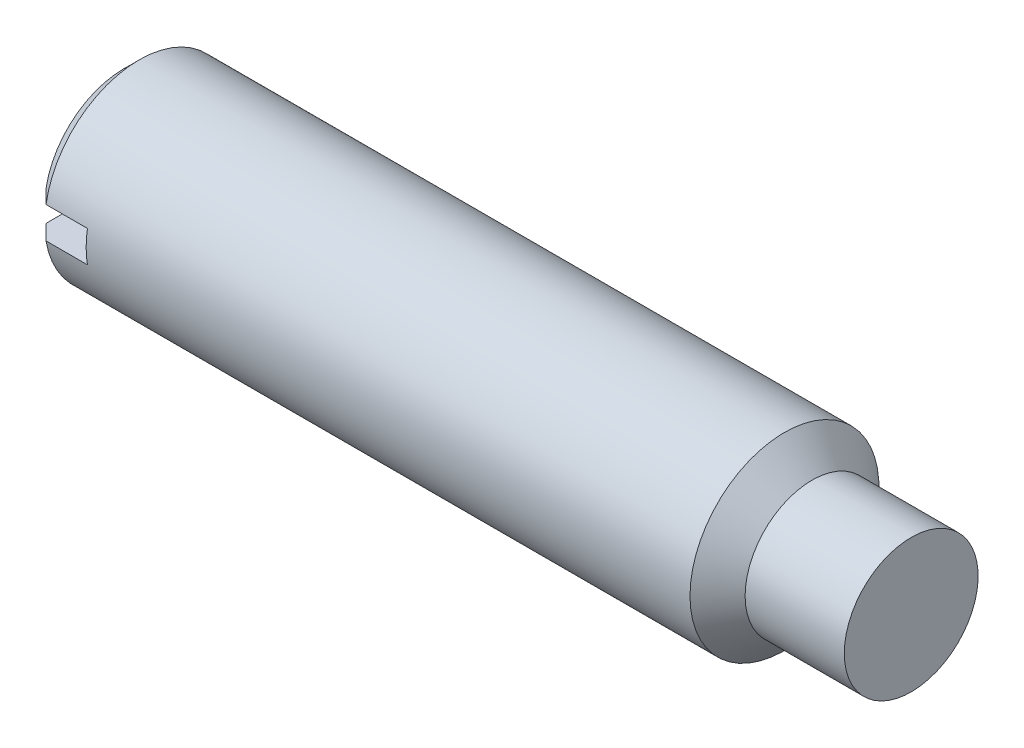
ISO-10303-21;
HEADER;
FILE_DESCRIPTION(('STEP AP214'),'2;1');
FILE_NAME('part.step','',(''),(''),'','','');
FILE_SCHEMA(('AUTOMOTIVE_DESIGN { 1 0 10303 214 1 1 1 1 }'));
ENDSEC;
DATA;
#1=APPLICATION_CONTEXT('core data for automotive mechanical design processes');
#2=APPLICATION_PROTOCOL_DEFINITION('international standard','automotive_design',2000,#1);
#3=PRODUCT_CONTEXT('',#1,'mechanical');
#4=PRODUCT('Part','Part','',(#3));
#5=PRODUCT_RELATED_PRODUCT_CATEGORY('part','',(#4));
#6=PRODUCT_DEFINITION_FORMATION('','',#4);
#7=PRODUCT_DEFINITION_CONTEXT('part definition',#1,'design');
#8=PRODUCT_DEFINITION('design','',#6,#7);
#9=PRODUCT_DEFINITION_SHAPE('','',#8);
#10=(LENGTH_UNIT() NAMED_UNIT(*) SI_UNIT(.MILLI.,.METRE.));
#11=(NAMED_UNIT(*) PLANE_ANGLE_UNIT() SI_UNIT($,.RADIAN.));
#12=(NAMED_UNIT(*) SI_UNIT($,.STERADIAN.) SOLID_ANGLE_UNIT());
#13=UNCERTAINTY_MEASURE_WITH_UNIT(LENGTH_MEASURE(1.E-05),#10,'distance_accuracy_value','');
#14=(GEOMETRIC_REPRESENTATION_CONTEXT(3) GLOBAL_UNCERTAINTY_ASSIGNED_CONTEXT((#13)) GLOBAL_UNIT_ASSIGNED_CONTEXT((#10,
#11,#12)) REPRESENTATION_CONTEXT('',''));
#15=CARTESIAN_POINT('',(0.,0.,0.));
#16=DIRECTION('',(0.,0.,1.));
#17=DIRECTION('',(1.,0.,0.));
#18=AXIS2_PLACEMENT_3D('',#15,#16,#17);
#19=CARTESIAN_POINT('',(0.,0.,0.));
#20=DIRECTION('',(1.,0.,0.));
#21=DIRECTION('',(0.,0.,-1.));
#22=AXIS2_PLACEMENT_3D('',#19,#20,#21);
#23=PLANE('',#22);
#24=DIRECTION('',(0.,0.,-1.));
#25=VECTOR('',#24,1.);
#26=CARTESIAN_POINT('',(0.,-1.,6.));
#27=LINE('',#26,#25);
#28=CARTESIAN_POINT('',(0.,-1.,4.93571636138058));
#29=VERTEX_POINT('',#28);
#30=CARTESIAN_POINT('',(0.,-1.,-4.93571636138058));
#31=VERTEX_POINT('',#30);
#32=EDGE_CURVE('E173',#29,#31,#27,.T.);
#33=ORIENTED_EDGE('',*,*,#32,.T.);
#34=CARTESIAN_POINT('',(0.,0.,0.));
#35=DIRECTION('',(-1.,0.,0.));
#36=DIRECTION('',(0.,0.,1.));
#37=AXIS2_PLACEMENT_3D('',#34,#35,#36);
#38=CIRCLE('',#37,5.036);
#39=EDGE_CURVE('E108',#31,#29,#38,.T.);
#40=ORIENTED_EDGE('',*,*,#39,.T.);
#41=EDGE_LOOP('',(#33,#40));
#42=FACE_BOUND('',#41,.T.);
#43=ADVANCED_FACE('F32',(#42),#23,.F.);
#44=DIRECTION('',(0.,0.,1.));
#45=VECTOR('',#44,1.);
#46=CARTESIAN_POINT('',(0.,1.,6.));
#47=LINE('',#46,#45);
#48=CARTESIAN_POINT('',(0.,1.,-4.93571636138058));
#49=VERTEX_POINT('',#48);
#50=CARTESIAN_POINT('',(0.,1.,4.93571636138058));
#51=VERTEX_POINT('',#50);
#52=EDGE_CURVE('E94',#49,#51,#47,.T.);
#53=ORIENTED_EDGE('',*,*,#52,.T.);
#54=EDGE_CURVE('E104',#51,#49,#38,.T.);
#55=ORIENTED_EDGE('',*,*,#54,.T.);
#56=EDGE_LOOP('',(#53,#55));
#57=FACE_BOUND('',#56,.T.);
#58=ADVANCED_FACE('F167',(#57),#23,.F.);
#59=CARTESIAN_POINT('',(0.963999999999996,0.,0.));
#60=DIRECTION('',(1.,0.,0.));
#61=DIRECTION('',(0.,0.,-1.));
#62=AXIS2_PLACEMENT_3D('',#59,#60,#61);
#63=CONICAL_SURFACE('',#62,6.,0.78539816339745);
#64=CARTESIAN_POINT('',(8.1873950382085,-1.,-13.1855290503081));
#65=CARTESIAN_POINT('',(7.72173696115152,-1.,-12.7185219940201));
#66=CARTESIAN_POINT('',(7.25613875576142,-1.,-12.2514551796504));
#67=CARTESIAN_POINT('',(6.32512700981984,-1.,-11.3171039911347));
#68=CARTESIAN_POINT('',(5.85971347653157,-1.,-10.8498196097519));
#69=CARTESIAN_POINT('',(4.92876157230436,-1.,-9.91455900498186));
#70=CARTESIAN_POINT('',(4.46322344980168,-1.,-9.44658253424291));
#71=CARTESIAN_POINT('',(3.53260322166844,-1.,-8.51020895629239));
#72=CARTESIAN_POINT('',(3.06752110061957,-1.,-8.04181186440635));
#73=CARTESIAN_POINT('',(2.1582196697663,-1.,-7.12462717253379));
#74=CARTESIAN_POINT('',(1.71396996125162,-1.,-6.67586973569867));
#75=CARTESIAN_POINT('',(1.04846409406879,-1.,-6.00182834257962));
#76=CARTESIAN_POINT('',(0.82676180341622,-1.,-5.7769850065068));
#77=CARTESIAN_POINT('',(0.38378484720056,-1.,-5.32688183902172));
#78=CARTESIAN_POINT('',(0.162510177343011,-1.,-5.10162201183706));
#79=CARTESIAN_POINT('',(-0.279302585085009,-1.,-4.65061661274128));
#80=CARTESIAN_POINT('',(-0.499841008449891,-1.,-4.42487136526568));
#81=CARTESIAN_POINT('',(-0.939964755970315,-1.,-3.97243637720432));
#82=CARTESIAN_POINT('',(-1.15955004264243,-1.,-3.74574660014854));
#83=CARTESIAN_POINT('',(-1.59710724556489,-1.,-3.29088888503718));
#84=CARTESIAN_POINT('',(-1.81507945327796,-1.,-3.06272122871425));
#85=CARTESIAN_POINT('',(-2.13978630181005,-1.,-2.71835823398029));
#86=CARTESIAN_POINT('',(-2.24764335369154,-1.,-2.60322226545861));
#87=CARTESIAN_POINT('',(-2.46225552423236,-1.,-2.37192883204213));
#88=CARTESIAN_POINT('',(-2.56901066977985,-1.,-2.25577139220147));
#89=CARTESIAN_POINT('',(-2.70433037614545,-1.,-2.10638744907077));
#90=CARTESIAN_POINT('',(-2.73367252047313,-1.,-2.07386514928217));
#91=CARTESIAN_POINT('',(-2.79220629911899,-1.,-2.00868525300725));
#92=CARTESIAN_POINT('',(-2.82139793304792,-1.,-1.97602765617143));
#93=CARTESIAN_POINT('',(-2.90872232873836,-1.,-1.87782064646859));
#94=CARTESIAN_POINT('',(-2.96659914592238,-1.,-1.81204300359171));
#95=CARTESIAN_POINT('',(-3.08184804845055,-1.,-1.67922857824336));
#96=CARTESIAN_POINT('',(-3.13921368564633,-1.,-1.61218618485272));
#97=CARTESIAN_POINT('',(-3.25265645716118,-1.,-1.47704604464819));
#98=CARTESIAN_POINT('',(-3.30873392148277,-1.,-1.40894857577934));
#99=CARTESIAN_POINT('',(-3.41951675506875,-1.,-1.27072673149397));
#100=CARTESIAN_POINT('',(-3.47420734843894,-1.,-1.20059041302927));
#101=CARTESIAN_POINT('',(-3.58078617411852,-1.,-1.05824293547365));
#102=CARTESIAN_POINT('',(-3.63267529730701,-1.,-0.98603244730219));
#103=CARTESIAN_POINT('',(-3.73179995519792,-1.,-0.838985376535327));
#104=CARTESIAN_POINT('',(-3.77906004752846,-1.,-0.764165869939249));
#105=CARTESIAN_POINT('',(-3.84435481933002,-1.,-0.648848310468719));
#106=CARTESIAN_POINT('',(-3.86516971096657,-1.,-0.60993361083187));
#107=CARTESIAN_POINT('',(-3.90433594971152,-1.,-0.530890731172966));
#108=CARTESIAN_POINT('',(-3.92268869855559,-1.,-0.490763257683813));
#109=CARTESIAN_POINT('',(-3.95198906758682,-1.,-0.419353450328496));
#110=CARTESIAN_POINT('',(-3.96364182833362,-1.,-0.38836204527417));
#111=CARTESIAN_POINT('',(-3.98473496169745,-1.,-0.325623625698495));
#112=CARTESIAN_POINT('',(-3.99417524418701,-1.,-0.29387658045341));
#113=CARTESIAN_POINT('',(-4.01039189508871,-1.,-0.229839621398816));
#114=CARTESIAN_POINT('',(-4.01717916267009,-1.,-0.197552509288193));
#115=CARTESIAN_POINT('',(-4.02777094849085,-1.,-0.132494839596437));
#116=CARTESIAN_POINT('',(-4.03157640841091,-1.,-0.099724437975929));
#117=CARTESIAN_POINT('',(-4.03598217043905,-1.,-0.033637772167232));
#118=CARTESIAN_POINT('',(-4.03655046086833,-1.,-0.000319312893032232));
#119=CARTESIAN_POINT('',(-4.03436475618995,-1.,0.0662003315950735));
#120=CARTESIAN_POINT('',(-4.03161072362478,-1.,0.0994015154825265));
#121=CARTESIAN_POINT('',(-4.01857837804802,-1.,0.198547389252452));
#122=CARTESIAN_POINT('',(-4.00352127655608,-1.,0.263890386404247));
#123=CARTESIAN_POINT('',(-3.96875276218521,-1.,0.375679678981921));
#124=CARTESIAN_POINT('',(-3.95109708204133,-1.,0.422820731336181));
#125=CARTESIAN_POINT('',(-3.91176267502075,-1.,0.515422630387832));
#126=CARTESIAN_POINT('',(-3.89008085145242,-1.,0.560882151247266));
#127=CARTESIAN_POINT('',(-3.84368181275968,-1.,0.650461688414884));
#128=CARTESIAN_POINT('',(-3.81895103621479,-1.,0.694574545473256));
#129=CARTESIAN_POINT('',(-3.76733867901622,-1.,0.781486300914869));
#130=CARTESIAN_POINT('',(-3.74045800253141,-1.,0.824285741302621));
#131=CARTESIAN_POINT('',(-3.67977492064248,-1.,0.916951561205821));
#132=CARTESIAN_POINT('',(-3.64563502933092,-1.,0.966595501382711));
#133=CARTESIAN_POINT('',(-3.57571102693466,-1.,1.06471636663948));
#134=CARTESIAN_POINT('',(-3.53992659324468,-1.,1.11319305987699));
#135=CARTESIAN_POINT('',(-3.43072910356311,-1.,1.25732593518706));
#136=CARTESIAN_POINT('',(-3.35551889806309,-1.,1.35161593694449));
#137=CARTESIAN_POINT('',(-3.20214571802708,-1.,1.5381164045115));
#138=CARTESIAN_POINT('',(-3.12397592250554,-1.,1.63032117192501));
#139=CARTESIAN_POINT('',(-2.9658821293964,-1.,1.81314430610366));
#140=CARTESIAN_POINT('',(-2.88595886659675,-1.,1.90376330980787));
#141=CARTESIAN_POINT('',(-2.72475343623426,-1.,2.08410427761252));
#142=CARTESIAN_POINT('',(-2.64346888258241,-1.,2.17382409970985));
#143=CARTESIAN_POINT('',(-2.48004111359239,-1.,2.35249375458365));
#144=CARTESIAN_POINT('',(-2.39789781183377,-1.,2.44144350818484));
#145=CARTESIAN_POINT('',(-2.23311792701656,-1.,2.61862662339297));
#146=CARTESIAN_POINT('',(-2.15048230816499,-1.,2.70686088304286));
#147=CARTESIAN_POINT('',(-1.98474580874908,-1.,2.88288512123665));
#148=CARTESIAN_POINT('',(-1.90164494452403,-1.,2.97067511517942));
#149=CARTESIAN_POINT('',(-1.65336190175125,-1.,3.23190010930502));
#150=CARTESIAN_POINT('',(-1.48765764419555,-1.,3.40483867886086));
#151=CARTESIAN_POINT('',(-1.15536226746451,-1.,3.74986223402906));
#152=CARTESIAN_POINT('',(-0.988771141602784,-1.,3.92194721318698));
#153=CARTESIAN_POINT('',(-0.488104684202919,-1.,4.43735511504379));
#154=CARTESIAN_POINT('',(-0.153146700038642,-1.,4.77982011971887));
#155=CARTESIAN_POINT('',(0.518172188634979,-1.,5.46378768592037));
#156=CARTESIAN_POINT('',(0.854533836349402,-1.,5.80528951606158));
#157=CARTESIAN_POINT('',(1.52796905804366,-1.,6.48758005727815));
#158=CARTESIAN_POINT('',(1.865042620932,-1.,6.8283687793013));
#159=CARTESIAN_POINT('',(2.53882709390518,-1.,7.508674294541));
#160=CARTESIAN_POINT('',(2.87553691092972,-1.,7.84819217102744));
#161=CARTESIAN_POINT('',(3.54926455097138,-1.,8.52692488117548));
#162=CARTESIAN_POINT('',(3.88628237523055,-1.,8.86613971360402));
#163=CARTESIAN_POINT('',(4.89754654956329,-1.,9.88335866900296));
#164=CARTESIAN_POINT('',(5.57211148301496,-1.,10.5610460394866));
#165=CARTESIAN_POINT('',(6.40850112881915,-1.,11.4007367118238));
#166=CARTESIAN_POINT('',(6.57010906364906,-1.,11.5629560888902));
#167=CARTESIAN_POINT('',(6.8933536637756,-1.,11.887374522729));
#168=CARTESIAN_POINT('',(7.05499032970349,-1.,12.0495735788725));
#169=CARTESIAN_POINT('',(7.37841272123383,-1.,12.3740784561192));
#170=CARTESIAN_POINT('',(7.54019846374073,-1.,12.5363842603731));
#171=CARTESIAN_POINT('',(7.86378498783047,-1.,12.8609725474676));
#172=CARTESIAN_POINT('',(8.02558576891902,-1.,13.0232550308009));
#173=CARTESIAN_POINT('',(8.1873950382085,-1.,13.1855290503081));
#174=B_SPLINE_CURVE_WITH_KNOTS('',3,(#64,#65,#66,#67,#68,#69,#70,#71,#72,#73,#74,#75,#76,#77,
#78,#79,#80,#81,#82,#83,#84,#85,#86,#87,#88,#89,#90,#91,#92,#93,#94,#95,#96,#97,#98,#99,#100,
#101,#102,#103,#104,#105,#106,#107,#108,#109,#110,#111,#112,#113,#114,#115,#116,#117,#118,#119,
#120,#121,#122,#123,#124,#125,#126,#127,#128,#129,#130,#131,#132,#133,#134,#135,#136,#137,#138,
#139,#140,#141,#142,#143,#144,#145,#146,#147,#148,#149,#150,#151,#152,#153,#154,#155,#156,#157,
#158,#159,#160,#161,#162,#163,#164,#165,#166,#167,#168,#169,#170,#171,#172,#173),.UNSPECIFIED.,
.F.,.F.,(4,2,2,2,2,2,2,2,2,2,2,2,2,2,2,2,2,2,2,2,2,2,2,2,2,2,2,2,2,2,2,2,2,2,2,2,2,2,2,2,2,2,2,
2,2,2,2,2,2,2,2,2,2,2,4),(0.,1.97848364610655,3.95703862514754,5.93732867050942,
7.91754927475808,9.81192615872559,10.7592155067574,11.7064952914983,12.6532681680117,
13.6000779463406,14.546712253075,15.0199999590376,15.4932760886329,15.6246832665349,
15.7560907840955,16.0189300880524,16.2836250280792,16.5482513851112,16.8150192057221,
17.0817016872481,17.3468825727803,17.4792167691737,17.6114753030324,17.7107371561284,
17.8100030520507,17.9088567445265,18.007679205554,18.1074772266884,18.2072763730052,
18.4072998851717,18.5581246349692,18.7090658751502,18.8607045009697,19.012279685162,
19.1929820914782,19.3737200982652,19.7354462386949,20.0980639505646,20.4605325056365,
20.8237218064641,21.1869480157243,21.5496101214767,21.9122595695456,22.6307874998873,
23.3493208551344,24.7864327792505,26.2244388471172,27.6624226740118,29.0969303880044,
30.53144391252,33.4000113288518,34.0869540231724,34.773914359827,35.4614172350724,
36.148902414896),.UNSPECIFIED.);
#175=CARTESIAN_POINT('',(0.963999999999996,-1.,-5.91607978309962));
#176=VERTEX_POINT('',#175);
#177=EDGE_CURVE('E126',#176,#31,#174,.T.);
#178=ORIENTED_EDGE('',*,*,#177,.F.);
#179=CARTESIAN_POINT('',(0.963999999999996,0.,0.));
#180=DIRECTION('',(-1.,0.,0.));
#181=DIRECTION('',(0.,0.,1.));
#182=AXIS2_PLACEMENT_3D('',#179,#180,#181);
#183=CIRCLE('',#182,6.);
#184=CARTESIAN_POINT('',(0.963999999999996,-1.,5.91607978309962));
#185=VERTEX_POINT('',#184);
#186=EDGE_CURVE('E115',#176,#185,#183,.T.);
#187=ORIENTED_EDGE('',*,*,#186,.T.);
#188=EDGE_CURVE('E52',#29,#185,#174,.T.);
#189=ORIENTED_EDGE('',*,*,#188,.F.);
#190=ORIENTED_EDGE('',*,*,#39,.F.);
#191=EDGE_LOOP('',(#178,#187,#189,#190));
#192=FACE_BOUND('',#191,.T.);
#193=ADVANCED_FACE('F139',(#192),#63,.T.);
#194=CARTESIAN_POINT('',(8.18739503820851,1.,13.1855290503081));
#195=CARTESIAN_POINT('',(7.72173696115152,1.,12.7185219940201));
#196=CARTESIAN_POINT('',(7.25613875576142,1.,12.2514551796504));
#197=CARTESIAN_POINT('',(6.32512700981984,1.,11.3171039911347));
#198=CARTESIAN_POINT('',(5.85971347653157,1.,10.8498196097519));
#199=CARTESIAN_POINT('',(4.92876157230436,1.,9.91455900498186));
#200=CARTESIAN_POINT('',(4.46322344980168,1.,9.44658253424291));
#201=CARTESIAN_POINT('',(3.53260322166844,1.,8.51020895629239));
#202=CARTESIAN_POINT('',(3.06752110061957,1.,8.04181186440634));
#203=CARTESIAN_POINT('',(2.15821966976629,1.,7.12462717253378));
#204=CARTESIAN_POINT('',(1.71396996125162,1.,6.67586973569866));
#205=CARTESIAN_POINT('',(1.04846409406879,1.,6.00182834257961));
#206=CARTESIAN_POINT('',(0.826761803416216,1.,5.7769850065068));
#207=CARTESIAN_POINT('',(0.383784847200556,1.,5.32688183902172));
#208=CARTESIAN_POINT('',(0.162510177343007,1.,5.10162201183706));
#209=CARTESIAN_POINT('',(-0.279302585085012,1.,4.65061661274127));
#210=CARTESIAN_POINT('',(-0.499841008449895,1.,4.42487136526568));
#211=CARTESIAN_POINT('',(-0.939964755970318,1.,3.97243637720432));
#212=CARTESIAN_POINT('',(-1.15955004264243,1.,3.74574660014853));
#213=CARTESIAN_POINT('',(-1.59710724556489,1.,3.29088888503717));
#214=CARTESIAN_POINT('',(-1.81507945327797,1.,3.06272122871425));
#215=CARTESIAN_POINT('',(-2.13978630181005,1.,2.71835823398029));
#216=CARTESIAN_POINT('',(-2.24764335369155,1.,2.6032222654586));
#217=CARTESIAN_POINT('',(-2.46225552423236,1.,2.37192883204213));
#218=CARTESIAN_POINT('',(-2.56901066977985,1.,2.25577139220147));
#219=CARTESIAN_POINT('',(-2.70433037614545,1.,2.10638744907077));
#220=CARTESIAN_POINT('',(-2.73367252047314,1.,2.07386514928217));
#221=CARTESIAN_POINT('',(-2.79220629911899,1.,2.00868525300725));
#222=CARTESIAN_POINT('',(-2.82139793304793,1.,1.97602765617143));
#223=CARTESIAN_POINT('',(-2.90872232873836,1.,1.87782064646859));
#224=CARTESIAN_POINT('',(-2.96659914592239,1.,1.8120430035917));
#225=CARTESIAN_POINT('',(-3.08184804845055,1.,1.67922857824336));
#226=CARTESIAN_POINT('',(-3.13921368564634,1.,1.61218618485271));
#227=CARTESIAN_POINT('',(-3.25265645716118,1.,1.47704604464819));
#228=CARTESIAN_POINT('',(-3.30873392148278,1.,1.40894857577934));
#229=CARTESIAN_POINT('',(-3.41951675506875,1.,1.27072673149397));
#230=CARTESIAN_POINT('',(-3.47420734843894,1.,1.20059041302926));
#231=CARTESIAN_POINT('',(-3.58078617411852,1.,1.05824293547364));
#232=CARTESIAN_POINT('',(-3.63267529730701,1.,0.986032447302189));
#233=CARTESIAN_POINT('',(-3.73179995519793,1.,0.838985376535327));
#234=CARTESIAN_POINT('',(-3.77906004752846,1.,0.764165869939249));
#235=CARTESIAN_POINT('',(-3.84435481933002,1.,0.648848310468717));
#236=CARTESIAN_POINT('',(-3.86516971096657,1.,0.609933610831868));
#237=CARTESIAN_POINT('',(-3.90433594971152,1.,0.530890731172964));
#238=CARTESIAN_POINT('',(-3.92268869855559,1.,0.490763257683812));
#239=CARTESIAN_POINT('',(-3.95198906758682,1.,0.419353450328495));
#240=CARTESIAN_POINT('',(-3.96364182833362,1.,0.38836204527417));
#241=CARTESIAN_POINT('',(-3.98473496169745,1.,0.325623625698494));
#242=CARTESIAN_POINT('',(-3.99417524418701,1.,0.293876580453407));
#243=CARTESIAN_POINT('',(-4.01039189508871,1.,0.229839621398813));
#244=CARTESIAN_POINT('',(-4.01717916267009,1.,0.197552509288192));
#245=CARTESIAN_POINT('',(-4.02777094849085,1.,0.132494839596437));
#246=CARTESIAN_POINT('',(-4.03157640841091,1.,0.0997244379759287));
#247=CARTESIAN_POINT('',(-4.03598217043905,1.,0.033637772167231));
#248=CARTESIAN_POINT('',(-4.03655046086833,1.,0.000319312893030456));
#249=CARTESIAN_POINT('',(-4.03436475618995,1.,-0.0662003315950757));
#250=CARTESIAN_POINT('',(-4.03161072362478,1.,-0.0994015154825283));
#251=CARTESIAN_POINT('',(-4.01857837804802,1.,-0.198547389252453));
#252=CARTESIAN_POINT('',(-4.00352127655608,1.,-0.263890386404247));
#253=CARTESIAN_POINT('',(-3.96875276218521,1.,-0.37567967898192));
#254=CARTESIAN_POINT('',(-3.95109708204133,1.,-0.422820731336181));
#255=CARTESIAN_POINT('',(-3.91176267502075,1.,-0.515422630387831));
#256=CARTESIAN_POINT('',(-3.89008085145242,1.,-0.560882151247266));
#257=CARTESIAN_POINT('',(-3.84368181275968,1.,-0.650461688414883));
#258=CARTESIAN_POINT('',(-3.81895103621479,1.,-0.694574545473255));
#259=CARTESIAN_POINT('',(-3.76733867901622,1.,-0.781486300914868));
#260=CARTESIAN_POINT('',(-3.74045800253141,1.,-0.82428574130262));
#261=CARTESIAN_POINT('',(-3.67977492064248,1.,-0.91695156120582));
#262=CARTESIAN_POINT('',(-3.64563502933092,1.,-0.966595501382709));
#263=CARTESIAN_POINT('',(-3.57571102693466,1.,-1.06471636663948));
#264=CARTESIAN_POINT('',(-3.53992659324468,1.,-1.11319305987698));
#265=CARTESIAN_POINT('',(-3.43072910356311,1.,-1.25732593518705));
#266=CARTESIAN_POINT('',(-3.35551889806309,1.,-1.35161593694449));
#267=CARTESIAN_POINT('',(-3.20214571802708,1.,-1.5381164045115));
#268=CARTESIAN_POINT('',(-3.12397592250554,1.,-1.63032117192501));
#269=CARTESIAN_POINT('',(-2.9658821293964,1.,-1.81314430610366));
#270=CARTESIAN_POINT('',(-2.88595886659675,1.,-1.90376330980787));
#271=CARTESIAN_POINT('',(-2.72475343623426,1.,-2.08410427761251));
#272=CARTESIAN_POINT('',(-2.64346888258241,1.,-2.17382409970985));
#273=CARTESIAN_POINT('',(-2.48004111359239,1.,-2.35249375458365));
#274=CARTESIAN_POINT('',(-2.39789781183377,1.,-2.44144350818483));
#275=CARTESIAN_POINT('',(-2.23311792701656,1.,-2.61862662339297));
#276=CARTESIAN_POINT('',(-2.150482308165,1.,-2.70686088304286));
#277=CARTESIAN_POINT('',(-1.98474580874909,1.,-2.88288512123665));
#278=CARTESIAN_POINT('',(-1.90164494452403,1.,-2.97067511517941));
#279=CARTESIAN_POINT('',(-1.65336190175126,1.,-3.23190010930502));
#280=CARTESIAN_POINT('',(-1.48765764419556,1.,-3.40483867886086));
#281=CARTESIAN_POINT('',(-1.15536226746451,1.,-3.74986223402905));
#282=CARTESIAN_POINT('',(-0.988771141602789,1.,-3.92194721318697));
#283=CARTESIAN_POINT('',(-0.488104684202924,1.,-4.43735511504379));
#284=CARTESIAN_POINT('',(-0.153146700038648,1.,-4.77982011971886));
#285=CARTESIAN_POINT('',(0.518172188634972,1.,-5.46378768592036));
#286=CARTESIAN_POINT('',(0.854533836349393,1.,-5.80528951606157));
#287=CARTESIAN_POINT('',(1.52796905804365,1.,-6.48758005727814));
#288=CARTESIAN_POINT('',(1.86504262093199,1.,-6.82836877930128));
#289=CARTESIAN_POINT('',(2.53882709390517,1.,-7.50867429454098));
#290=CARTESIAN_POINT('',(2.87553691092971,1.,-7.84819217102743));
#291=CARTESIAN_POINT('',(3.54926455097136,1.,-8.52692488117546));
#292=CARTESIAN_POINT('',(3.88628237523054,1.,-8.866139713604));
#293=CARTESIAN_POINT('',(4.89754654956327,1.,-9.88335866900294));
#294=CARTESIAN_POINT('',(5.57211148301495,1.,-10.5610460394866));
#295=CARTESIAN_POINT('',(6.40850112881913,1.,-11.4007367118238));
#296=CARTESIAN_POINT('',(6.57010906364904,1.,-11.5629560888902));
#297=CARTESIAN_POINT('',(6.89335366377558,1.,-11.887374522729));
#298=CARTESIAN_POINT('',(7.05499032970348,1.,-12.0495735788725));
#299=CARTESIAN_POINT('',(7.37841272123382,1.,-12.3740784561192));
#300=CARTESIAN_POINT('',(7.54019846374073,1.,-12.5363842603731));
#301=CARTESIAN_POINT('',(7.86378498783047,1.,-12.8609725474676));
#302=CARTESIAN_POINT('',(8.02558576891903,1.,-13.0232550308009));
#303=CARTESIAN_POINT('',(8.18739503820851,1.,-13.1855290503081));
#304=B_SPLINE_CURVE_WITH_KNOTS('',3,(#194,#195,#196,#197,#198,#199,#200,#201,#202,#203,#204,
#205,#206,#207,#208,#209,#210,#211,#212,#213,#214,#215,#216,#217,#218,#219,#220,#221,#222,#223,
#224,#225,#226,#227,#228,#229,#230,#231,#232,#233,#234,#235,#236,#237,#238,#239,#240,#241,#242,
#243,#244,#245,#246,#247,#248,#249,#250,#251,#252,#253,#254,#255,#256,#257,#258,#259,#260,#261,
#262,#263,#264,#265,#266,#267,#268,#269,#270,#271,#272,#273,#274,#275,#276,#277,#278,#279,#280,
#281,#282,#283,#284,#285,#286,#287,#288,#289,#290,#291,#292,#293,#294,#295,#296,#297,#298,#299,
#300,#301,#302,#303),.UNSPECIFIED.,.F.,.F.,(4,2,2,2,2,2,2,2,2,2,2,2,2,2,2,2,2,2,2,2,2,2,2,2,2,2,
2,2,2,2,2,2,2,2,2,2,2,2,2,2,2,2,2,2,2,2,2,2,2,2,2,2,2,2,4),(0.,1.97848364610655,
3.95703862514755,5.93732867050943,7.91754927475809,9.8119261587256,10.7592155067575,
11.7064952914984,12.6532681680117,13.6000779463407,14.546712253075,15.0199999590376,
15.4932760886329,15.624683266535,15.7560907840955,16.0189300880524,16.2836250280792,
16.5482513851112,16.8150192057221,17.0817016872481,17.3468825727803,17.4792167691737,
17.6114753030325,17.7107371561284,17.8100030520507,17.9088567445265,18.007679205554,
18.1074772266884,18.2072763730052,18.4072998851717,18.5581246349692,18.7090658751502,
18.8607045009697,19.012279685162,19.1929820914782,19.3737200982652,19.7354462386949,
20.0980639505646,20.4605325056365,20.8237218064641,21.1869480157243,21.5496101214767,
21.9122595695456,22.6307874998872,23.3493208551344,24.7864327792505,26.2244388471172,
27.6624226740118,29.0969303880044,30.53144391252,33.4000113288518,34.0869540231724,
34.773914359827,35.4614172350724,36.148902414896),.UNSPECIFIED.);
#305=CARTESIAN_POINT('',(0.963999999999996,1.,5.91607978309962));
#306=VERTEX_POINT('',#305);
#307=EDGE_CURVE('E132',#306,#51,#304,.T.);
#308=ORIENTED_EDGE('',*,*,#307,.F.);
#309=CARTESIAN_POINT('',(0.963999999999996,1.,-5.91607978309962));
#310=VERTEX_POINT('',#309);
#311=EDGE_CURVE('E113',#306,#310,#183,.T.);
#312=ORIENTED_EDGE('',*,*,#311,.T.);
#313=EDGE_CURVE('E133',#49,#310,#304,.T.);
#314=ORIENTED_EDGE('',*,*,#313,.F.);
#315=ORIENTED_EDGE('',*,*,#54,.F.);
#316=EDGE_LOOP('',(#308,#312,#314,#315));
#317=FACE_BOUND('',#316,.T.);
#318=ADVANCED_FACE('F160',(#317),#63,.T.);
#319=CARTESIAN_POINT('',(0.,0.,0.));
#320=DIRECTION('',(-1.,0.,0.));
#321=DIRECTION('',(0.,0.,1.));
#322=AXIS2_PLACEMENT_3D('',#319,#320,#321);
#323=CYLINDRICAL_SURFACE('',#322,6.);
#324=CARTESIAN_POINT('',(41.95,0.,0.));
#325=DIRECTION('',(-1.,0.,0.));
#326=DIRECTION('',(0.,0.,1.));
#327=AXIS2_PLACEMENT_3D('',#324,#325,#326);
#328=CIRCLE('',#327,6.);
#329=CARTESIAN_POINT('',(41.95,0.,6.));
#330=VERTEX_POINT('',#329);
#331=EDGE_CURVE('E117',#330,#330,#328,.T.);
#332=ORIENTED_EDGE('',*,*,#331,.T.);
#333=EDGE_LOOP('',(#332));
#334=FACE_BOUND('',#333,.T.);
#335=DIRECTION('',(-1.,0.,0.));
#336=VECTOR('',#335,1.);
#337=CARTESIAN_POINT('',(0.,-1.,5.91607978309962));
#338=LINE('',#337,#336);
#339=CARTESIAN_POINT('',(3.6,-1.,5.91607978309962));
#340=VERTEX_POINT('',#339);
#341=EDGE_CURVE('E11',#185,#340,#338,.F.);
#342=ORIENTED_EDGE('',*,*,#341,.F.);
#343=ORIENTED_EDGE('',*,*,#186,.F.);
#344=DIRECTION('',(-1.,0.,0.));
#345=VECTOR('',#344,1.);
#346=CARTESIAN_POINT('',(0.,-1.,-5.91607978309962));
#347=LINE('',#346,#345);
#348=CARTESIAN_POINT('',(3.6,-1.,-5.91607978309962));
#349=VERTEX_POINT('',#348);
#350=EDGE_CURVE('E46',#349,#176,#347,.T.);
#351=ORIENTED_EDGE('',*,*,#350,.F.);
#352=CARTESIAN_POINT('',(3.6,0.,0.));
#353=DIRECTION('',(1.,0.,0.));
#354=DIRECTION('',(0.,0.,-1.));
#355=AXIS2_PLACEMENT_3D('',#352,#353,#354);
#356=CIRCLE('',#355,6.);
#357=CARTESIAN_POINT('',(3.6,1.,-5.91607978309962));
#358=VERTEX_POINT('',#357);
#359=EDGE_CURVE('E92',#349,#358,#356,.T.);
#360=ORIENTED_EDGE('',*,*,#359,.T.);
#361=DIRECTION('',(-1.,0.,0.));
#362=VECTOR('',#361,1.);
#363=CARTESIAN_POINT('',(0.,1.,-5.91607978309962));
#364=LINE('',#363,#362);
#365=EDGE_CURVE('E100',#310,#358,#364,.F.);
#366=ORIENTED_EDGE('',*,*,#365,.F.);
#367=ORIENTED_EDGE('',*,*,#311,.F.);
#368=DIRECTION('',(-1.,0.,0.));
#369=VECTOR('',#368,1.);
#370=CARTESIAN_POINT('',(0.,1.,5.91607978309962));
#371=LINE('',#370,#369);
#372=CARTESIAN_POINT('',(3.6,1.,5.91607978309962));
#373=VERTEX_POINT('',#372);
#374=EDGE_CURVE('E39',#373,#306,#371,.T.);
#375=ORIENTED_EDGE('',*,*,#374,.F.);
#376=EDGE_CURVE('E90',#373,#340,#356,.T.);
#377=ORIENTED_EDGE('',*,*,#376,.T.);
#378=EDGE_LOOP('',(#342,#343,#351,#360,#366,#367,#375,#377));
#379=FACE_BOUND('',#378,.T.);
#380=ADVANCED_FACE('F97',(#334,#379),#323,.T.);
#381=CARTESIAN_POINT('',(43.7,0.,0.));
#382=DIRECTION('',(-1.,0.,0.));
#383=DIRECTION('',(0.,0.,1.));
#384=AXIS2_PLACEMENT_3D('',#381,#382,#383);
#385=CONICAL_SURFACE('',#384,4.25,0.785398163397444);
#386=ORIENTED_EDGE('',*,*,#331,.F.);
#387=EDGE_LOOP('',(#386));
#388=FACE_BOUND('',#387,.T.);
#389=CARTESIAN_POINT('',(43.7,0.,0.));
#390=DIRECTION('',(-1.,0.,0.));
#391=DIRECTION('',(0.,0.,1.));
#392=AXIS2_PLACEMENT_3D('',#389,#390,#391);
#393=CIRCLE('',#392,4.25);
#394=CARTESIAN_POINT('',(43.7,0.,4.25));
#395=VERTEX_POINT('',#394);
#396=EDGE_CURVE('E120',#395,#395,#393,.T.);
#397=ORIENTED_EDGE('',*,*,#396,.T.);
#398=EDGE_LOOP('',(#397));
#399=FACE_BOUND('',#398,.T.);
#400=ADVANCED_FACE('F155',(#388,#399),#385,.T.);
#401=CARTESIAN_POINT('',(0.,0.,0.));
#402=DIRECTION('',(-1.,0.,0.));
#403=DIRECTION('',(0.,0.,1.));
#404=AXIS2_PLACEMENT_3D('',#401,#402,#403);
#405=CYLINDRICAL_SURFACE('',#404,4.25);
#406=ORIENTED_EDGE('',*,*,#396,.F.);
#407=EDGE_LOOP('',(#406));
#408=FACE_BOUND('',#407,.T.);
#409=CARTESIAN_POINT('',(50.,0.,0.));
#410=DIRECTION('',(-1.,0.,0.));
#411=DIRECTION('',(0.,0.,1.));
#412=AXIS2_PLACEMENT_3D('',#409,#410,#411);
#413=CIRCLE('',#412,4.25);
#414=CARTESIAN_POINT('',(50.,0.,4.25));
#415=VERTEX_POINT('',#414);
#416=EDGE_CURVE('E123',#415,#415,#413,.T.);
#417=ORIENTED_EDGE('',*,*,#416,.T.);
#418=EDGE_LOOP('',(#417));
#419=FACE_BOUND('',#418,.T.);
#420=ADVANCED_FACE('F151',(#408,#419),#405,.T.);
#421=CARTESIAN_POINT('',(50.,4.25,0.));
#422=DIRECTION('',(-1.,0.,0.));
#423=DIRECTION('',(0.,0.,1.));
#424=AXIS2_PLACEMENT_3D('',#421,#422,#423);
#425=PLANE('',#424);
#426=ORIENTED_EDGE('',*,*,#416,.F.);
#427=EDGE_LOOP('',(#426));
#428=FACE_BOUND('',#427,.T.);
#429=ADVANCED_FACE('F146',(#428),#425,.F.);
#430=CARTESIAN_POINT('',(3.6,-1.,6.));
#431=DIRECTION('',(0.,1.,0.));
#432=DIRECTION('',(0.,0.,1.));
#433=AXIS2_PLACEMENT_3D('',#430,#431,#432);
#434=PLANE('',#433);
#435=ORIENTED_EDGE('',*,*,#177,.T.);
#436=ORIENTED_EDGE('',*,*,#32,.F.);
#437=ORIENTED_EDGE('',*,*,#188,.T.);
#438=ORIENTED_EDGE('',*,*,#341,.T.);
#439=DIRECTION('',(0.,0.,-1.));
#440=VECTOR('',#439,1.);
#441=CARTESIAN_POINT('',(3.6,-1.,6.));
#442=LINE('',#441,#440);
#443=EDGE_CURVE('E82',#340,#349,#442,.T.);
#444=ORIENTED_EDGE('',*,*,#443,.T.);
#445=ORIENTED_EDGE('',*,*,#350,.T.);
#446=EDGE_LOOP('',(#435,#436,#437,#438,#444,#445));
#447=FACE_BOUND('',#446,.T.);
#448=ADVANCED_FACE('F81',(#447),#434,.T.);
#449=CARTESIAN_POINT('',(3.6,1.,6.));
#450=DIRECTION('',(0.,-1.,0.));
#451=DIRECTION('',(0.,0.,-1.));
#452=AXIS2_PLACEMENT_3D('',#449,#450,#451);
#453=PLANE('',#452);
#454=ORIENTED_EDGE('',*,*,#307,.T.);
#455=ORIENTED_EDGE('',*,*,#52,.F.);
#456=ORIENTED_EDGE('',*,*,#313,.T.);
#457=ORIENTED_EDGE('',*,*,#365,.T.);
#458=DIRECTION('',(0.,0.,1.));
#459=VECTOR('',#458,1.);
#460=CARTESIAN_POINT('',(3.6,1.,6.));
#461=LINE('',#460,#459);
#462=EDGE_CURVE('E93',#358,#373,#461,.T.);
#463=ORIENTED_EDGE('',*,*,#462,.T.);
#464=ORIENTED_EDGE('',*,*,#374,.T.);
#465=EDGE_LOOP('',(#454,#455,#456,#457,#463,#464));
#466=FACE_BOUND('',#465,.T.);
#467=ADVANCED_FACE('F145',(#466),#453,.T.);
#468=CARTESIAN_POINT('',(3.6,-1.,6.));
#469=DIRECTION('',(1.,0.,0.));
#470=DIRECTION('',(0.,0.,-1.));
#471=AXIS2_PLACEMENT_3D('',#468,#469,#470);
#472=PLANE('',#471);
#473=ORIENTED_EDGE('',*,*,#462,.F.);
#474=ORIENTED_EDGE('',*,*,#359,.F.);
#475=ORIENTED_EDGE('',*,*,#443,.F.);
#476=ORIENTED_EDGE('',*,*,#376,.F.);
#477=EDGE_LOOP('',(#473,#474,#475,#476));
#478=FACE_BOUND('',#477,.T.);
#479=ADVANCED_FACE('F89',(#478),#472,.F.);
#480=CLOSED_SHELL('',(#43,#58,#193,#318,#380,#400,#420,#429,#448,#467,#479));
#481=MANIFOLD_SOLID_BREP('B2',#480);
#482=ADVANCED_BREP_SHAPE_REPRESENTATION('',(#18,#481),#14);
#483=SHAPE_DEFINITION_REPRESENTATION(#9,#482);
ENDSEC;
END-ISO-10303-21;
